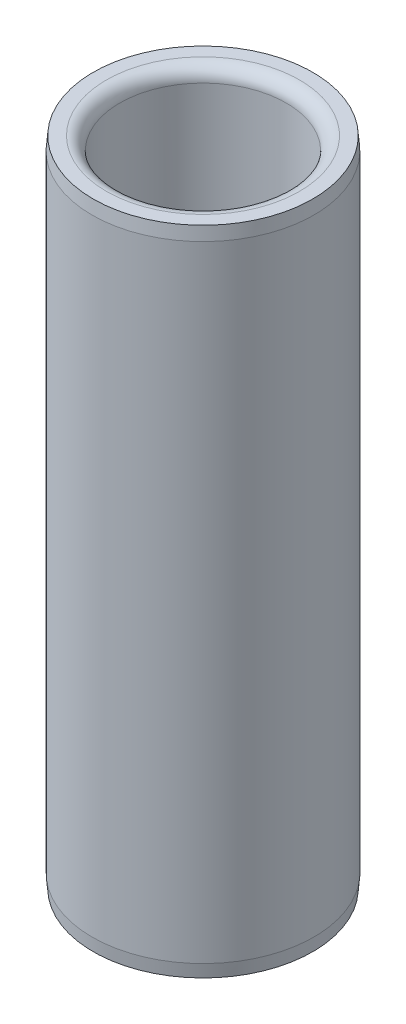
from build123d import *

# Parameters (mm, degrees)
SKETCH2_W      = 6.34365
SKETCH2_H      = 149.225
CHAMFER2_SIZE  = 3.048
CHAMFER2_SIZE2 = 0.266665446
FILLET1_R      = 3.048


with BuildPart() as part:
    # Sketch2 → Revolve1 (revolve)
    with BuildSketch(Plane.XY, mode=Mode.PRIVATE) as revolve1_sk:
        with Locations((-22.228175, 74.6125)):
            Rectangle(SKETCH2_W, SKETCH2_H)
    revolve(revolve1_sk.sketch.rotate(Axis((0, 20.080482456, 0), (0, -1, 0)), 270), axis=Axis((0, 20.080482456, 0), (0, -1, 0)))

    # Chamfer2
    chamfer2_edges = [part.edges().sort_by_distance(p)[0] for p in [
        (0, 149.225, -25.4),
        (0, 0, -25.4),
    ]]
    chamfer2_side = [part.faces().sort_by_distance(p)[0] for p in [
        (0, 74.6125, -25.4),
    ]]
    chamfer(chamfer2_edges, length=CHAMFER2_SIZE, length2=CHAMFER2_SIZE2, reference=chamfer2_side[0])

    # Fillet1
    fillet1_edges = [part.edges().sort_by_distance(p)[0] for p in [
        (0, 149.225, -19.05635),
        (0, 0, -19.05635),
    ]]
    fillet(fillet1_edges, radius=FILLET1_R)


solid = part.part
